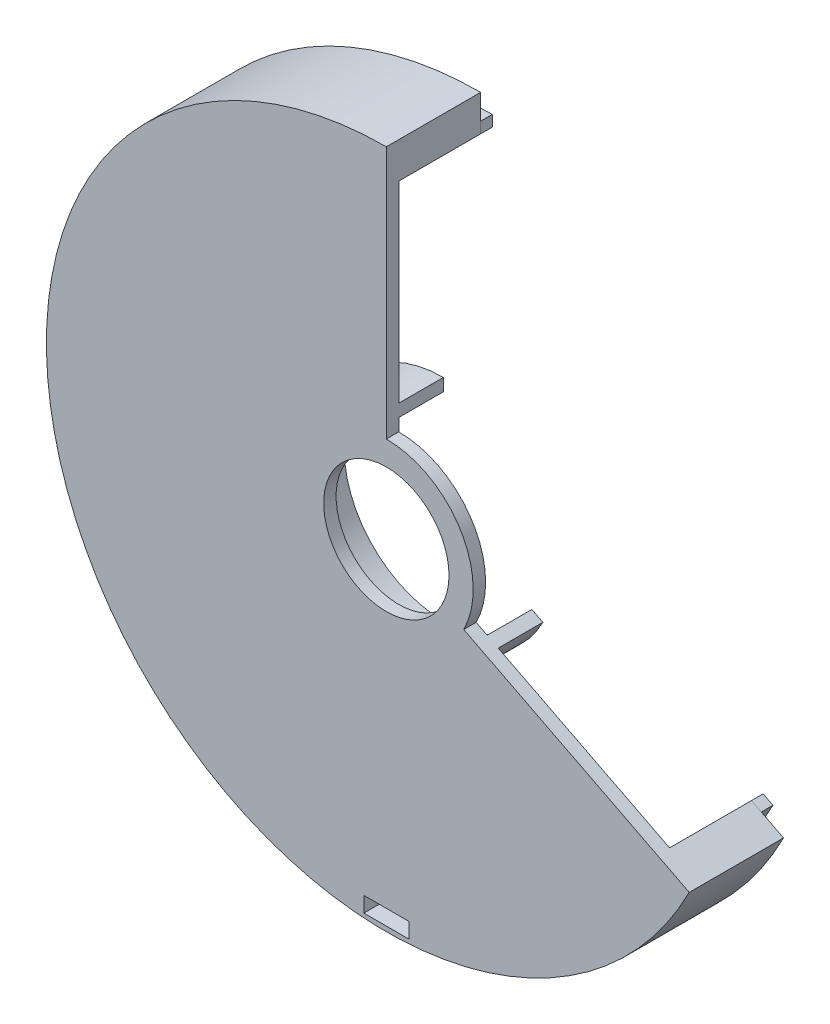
ISO-10303-21;
HEADER;
FILE_DESCRIPTION(('STEP AP214'),'2;1');
FILE_NAME('part.step','',(''),(''),'','','');
FILE_SCHEMA(('AUTOMOTIVE_DESIGN { 1 0 10303 214 1 1 1 1 }'));
ENDSEC;
DATA;
#1=APPLICATION_CONTEXT('core data for automotive mechanical design processes');
#2=APPLICATION_PROTOCOL_DEFINITION('international standard','automotive_design',2000,#1);
#3=PRODUCT_CONTEXT('',#1,'mechanical');
#4=PRODUCT('Part','Part','',(#3));
#5=PRODUCT_RELATED_PRODUCT_CATEGORY('part','',(#4));
#6=PRODUCT_DEFINITION_FORMATION('','',#4);
#7=PRODUCT_DEFINITION_CONTEXT('part definition',#1,'design');
#8=PRODUCT_DEFINITION('design','',#6,#7);
#9=PRODUCT_DEFINITION_SHAPE('','',#8);
#10=(LENGTH_UNIT() NAMED_UNIT(*) SI_UNIT(.MILLI.,.METRE.));
#11=(NAMED_UNIT(*) PLANE_ANGLE_UNIT() SI_UNIT($,.RADIAN.));
#12=(NAMED_UNIT(*) SI_UNIT($,.STERADIAN.) SOLID_ANGLE_UNIT());
#13=UNCERTAINTY_MEASURE_WITH_UNIT(LENGTH_MEASURE(1.E-05),#10,'distance_accuracy_value','');
#14=(GEOMETRIC_REPRESENTATION_CONTEXT(3) GLOBAL_UNCERTAINTY_ASSIGNED_CONTEXT((#13)) GLOBAL_UNIT_ASSIGNED_CONTEXT((#10,
#11,#12)) REPRESENTATION_CONTEXT('',''));
#15=CARTESIAN_POINT('',(0.,0.,0.));
#16=DIRECTION('',(0.,0.,1.));
#17=DIRECTION('',(1.,0.,0.));
#18=AXIS2_PLACEMENT_3D('',#15,#16,#17);
#19=CARTESIAN_POINT('',(0.,0.,24.69499995));
#20=DIRECTION('',(0.,0.,1.));
#21=DIRECTION('',(1.,0.,0.));
#22=AXIS2_PLACEMENT_3D('',#19,#20,#21);
#23=CYLINDRICAL_SURFACE('',#22,16.53875);
#24=CARTESIAN_POINT('',(0.,0.,24.69499995));
#25=DIRECTION('',(0.,0.,1.));
#26=DIRECTION('',(1.,0.,0.));
#27=AXIS2_PLACEMENT_3D('',#24,#25,#26);
#28=CIRCLE('',#27,16.53875);
#29=CARTESIAN_POINT('',(16.53875,0.,24.69499995));
#30=VERTEX_POINT('',#29);
#31=EDGE_CURVE('E232',#30,#30,#28,.T.);
#32=ORIENTED_EDGE('',*,*,#31,.F.);
#33=EDGE_LOOP('',(#32));
#34=FACE_BOUND('',#33,.T.);
#35=CARTESIAN_POINT('',(0.,0.,27.96999995));
#36=DIRECTION('',(0.,0.,1.));
#37=DIRECTION('',(1.,0.,0.));
#38=AXIS2_PLACEMENT_3D('',#35,#36,#37);
#39=CIRCLE('',#38,16.53875);
#40=CARTESIAN_POINT('',(16.53875,0.,27.96999995));
#41=VERTEX_POINT('',#40);
#42=EDGE_CURVE('E158',#41,#41,#39,.F.);
#43=ORIENTED_EDGE('',*,*,#42,.F.);
#44=EDGE_LOOP('',(#43));
#45=FACE_BOUND('',#44,.T.);
#46=ADVANCED_FACE('F44',(#34,#45),#23,.F.);
#47=CARTESIAN_POINT('',(0.,0.,44.34499995));
#48=DIRECTION('',(0.,0.,-1.));
#49=DIRECTION('',(-1.,0.,0.));
#50=AXIS2_PLACEMENT_3D('',#47,#48,#49);
#51=CYLINDRICAL_SURFACE('',#50,22.925);
#52=CARTESIAN_POINT('',(0.,0.,27.96999995));
#53=DIRECTION('',(0.,0.,1.));
#54=DIRECTION('',(1.,0.,0.));
#55=AXIS2_PLACEMENT_3D('',#52,#53,#54);
#56=CIRCLE('',#55,22.925);
#57=CARTESIAN_POINT('',(20.4263245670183,-10.4077322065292,27.96999995));
#58=VERTEX_POINT('',#57);
#59=CARTESIAN_POINT('',(0.,22.925,27.96999995));
#60=VERTEX_POINT('',#59);
#61=EDGE_CURVE('E146',#58,#60,#56,.T.);
#62=ORIENTED_EDGE('',*,*,#61,.F.);
#63=DIRECTION('',(0.,0.,1.));
#64=VECTOR('',#63,1.);
#65=CARTESIAN_POINT('',(20.4263245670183,-10.4077322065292,0.));
#66=LINE('',#65,#64);
#67=CARTESIAN_POINT('',(20.4263245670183,-10.4077322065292,24.69499995));
#68=VERTEX_POINT('',#67);
#69=EDGE_CURVE('E172',#68,#58,#66,.T.);
#70=ORIENTED_EDGE('',*,*,#69,.F.);
#71=CARTESIAN_POINT('',(0.,0.,24.69499995));
#72=DIRECTION('',(0.,0.,1.));
#73=DIRECTION('',(1.,0.,0.));
#74=AXIS2_PLACEMENT_3D('',#71,#72,#73);
#75=CIRCLE('',#74,22.925);
#76=CARTESIAN_POINT('',(0.,22.925,24.69499995));
#77=VERTEX_POINT('',#76);
#78=EDGE_CURVE('E167',#77,#68,#75,.F.);
#79=ORIENTED_EDGE('',*,*,#78,.F.);
#80=DIRECTION('',(0.,0.,1.));
#81=VECTOR('',#80,1.);
#82=CARTESIAN_POINT('',(0.,22.925,0.));
#83=LINE('',#82,#81);
#84=EDGE_CURVE('E163',#77,#60,#83,.T.);
#85=ORIENTED_EDGE('',*,*,#84,.T.);
#86=EDGE_LOOP('',(#62,#70,#79,#85));
#87=FACE_BOUND('',#86,.T.);
#88=ADVANCED_FACE('F170',(#87),#51,.T.);
#89=CARTESIAN_POINT('',(0.,0.,27.96999995));
#90=DIRECTION('',(0.,0.,1.));
#91=DIRECTION('',(1.,0.,0.));
#92=AXIS2_PLACEMENT_3D('',#89,#90,#91);
#93=PLANE('',#92);
#94=DIRECTION('',(-1.,0.,0.));
#95=VECTOR('',#94,1.);
#96=CARTESIAN_POINT('',(-5.94084999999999,-84.37055,27.96999995));
#97=LINE('',#96,#95);
#98=CARTESIAN_POINT('',(5.94084999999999,-84.37055,27.96999995));
#99=VERTEX_POINT('',#98);
#100=CARTESIAN_POINT('',(-5.94084999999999,-84.37055,27.96999995));
#101=VERTEX_POINT('',#100);
#102=EDGE_CURVE('E67',#99,#101,#97,.T.);
#103=ORIENTED_EDGE('',*,*,#102,.F.);
#104=DIRECTION('',(0.,1.,0.));
#105=VECTOR('',#104,1.);
#106=CARTESIAN_POINT('',(5.94084999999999,-88.425,27.96999995));
#107=LINE('',#106,#105);
#108=CARTESIAN_POINT('',(5.94084999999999,-88.425,27.96999995));
#109=VERTEX_POINT('',#108);
#110=EDGE_CURVE('E226',#109,#99,#107,.T.);
#111=ORIENTED_EDGE('',*,*,#110,.F.);
#112=DIRECTION('',(1.,0.,0.));
#113=VECTOR('',#112,1.);
#114=CARTESIAN_POINT('',(5.94084999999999,-88.425,27.96999995));
#115=LINE('',#114,#113);
#116=CARTESIAN_POINT('',(-5.94084999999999,-88.425,27.96999995));
#117=VERTEX_POINT('',#116);
#118=EDGE_CURVE('E223',#117,#109,#115,.T.);
#119=ORIENTED_EDGE('',*,*,#118,.F.);
#120=DIRECTION('',(0.,-1.,0.));
#121=VECTOR('',#120,1.);
#122=CARTESIAN_POINT('',(-5.94084999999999,-88.425,27.96999995));
#123=LINE('',#122,#121);
#124=EDGE_CURVE('E220',#101,#117,#123,.T.);
#125=ORIENTED_EDGE('',*,*,#124,.F.);
#126=EDGE_LOOP('',(#103,#111,#119,#125));
#127=FACE_BOUND('',#126,.T.);
#128=DIRECTION('',(0.891006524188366,-0.453990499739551,0.));
#129=VECTOR('',#128,1.);
#130=CARTESIAN_POINT('',(0.,0.,27.96999995));
#131=LINE('',#130,#129);
#132=CARTESIAN_POINT('',(79.954470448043,-40.7388374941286,27.96999995));
#133=VERTEX_POINT('',#132);
#134=EDGE_CURVE('E153',#58,#133,#131,.T.);
#135=ORIENTED_EDGE('',*,*,#134,.F.);
#136=ORIENTED_EDGE('',*,*,#61,.T.);
#137=DIRECTION('',(0.,1.,0.));
#138=VECTOR('',#137,1.);
#139=CARTESIAN_POINT('',(0.,0.,27.96999995));
#140=LINE('',#139,#138);
#141=CARTESIAN_POINT('',(0.,89.735,27.96999995));
#142=VERTEX_POINT('',#141);
#143=EDGE_CURVE('E151',#60,#142,#140,.T.);
#144=ORIENTED_EDGE('',*,*,#143,.T.);
#145=CARTESIAN_POINT('',(0.,0.,27.96999995));
#146=DIRECTION('',(0.,0.,1.));
#147=DIRECTION('',(1.,0.,0.));
#148=AXIS2_PLACEMENT_3D('',#145,#146,#147);
#149=CIRCLE('',#148,89.735);
#150=EDGE_CURVE('E245',#142,#133,#149,.T.);
#151=ORIENTED_EDGE('',*,*,#150,.T.);
#152=EDGE_LOOP('',(#135,#136,#144,#151));
#153=FACE_BOUND('',#152,.T.);
#154=ORIENTED_EDGE('',*,*,#42,.T.);
#155=EDGE_LOOP('',(#154));
#156=FACE_BOUND('',#155,.T.);
#157=ADVANCED_FACE('F148',(#127,#153,#156),#93,.T.);
#158=CARTESIAN_POINT('',(0.,0.,27.96999995));
#159=DIRECTION('',(0.,0.,-1.));
#160=DIRECTION('',(-1.,0.,0.));
#161=AXIS2_PLACEMENT_3D('',#158,#159,#160);
#162=CYLINDRICAL_SURFACE('',#161,80.2375);
#163=CARTESIAN_POINT('',(0.,0.,3.07999995));
#164=DIRECTION('',(0.,0.,1.));
#165=DIRECTION('',(1.,0.,0.));
#166=AXIS2_PLACEMENT_3D('',#163,#164,#165);
#167=CIRCLE('',#166,80.2375);
#168=CARTESIAN_POINT('',(0.,80.2375,3.07999995));
#169=VERTEX_POINT('',#168);
#170=CARTESIAN_POINT('',(71.492135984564,-36.4270627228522,3.07999995));
#171=VERTEX_POINT('',#170);
#172=EDGE_CURVE('E241',#169,#171,#167,.T.);
#173=ORIENTED_EDGE('',*,*,#172,.F.);
#174=DIRECTION('',(0.,0.,-1.));
#175=VECTOR('',#174,1.);
#176=CARTESIAN_POINT('',(0.,80.2375,27.96999995));
#177=LINE('',#176,#175);
#178=CARTESIAN_POINT('',(0.,80.2375,24.69499995));
#179=VERTEX_POINT('',#178);
#180=EDGE_CURVE('E205',#169,#179,#177,.F.);
#181=ORIENTED_EDGE('',*,*,#180,.T.);
#182=CARTESIAN_POINT('',(0.,0.,24.69499995));
#183=DIRECTION('',(0.,0.,1.));
#184=DIRECTION('',(1.,0.,0.));
#185=AXIS2_PLACEMENT_3D('',#182,#183,#184);
#186=CIRCLE('',#185,80.2375);
#187=CARTESIAN_POINT('',(71.492135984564,-36.4270627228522,24.69499995));
#188=VERTEX_POINT('',#187);
#189=EDGE_CURVE('E240',#179,#188,#186,.T.);
#190=ORIENTED_EDGE('',*,*,#189,.T.);
#191=DIRECTION('',(0.,0.,-1.));
#192=VECTOR('',#191,1.);
#193=CARTESIAN_POINT('',(71.492135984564,-36.4270627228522,27.96999995));
#194=LINE('',#193,#192);
#195=EDGE_CURVE('E190',#171,#188,#194,.F.);
#196=ORIENTED_EDGE('',*,*,#195,.F.);
#197=EDGE_LOOP('',(#173,#181,#190,#196));
#198=FACE_BOUND('',#197,.T.);
#199=ADVANCED_FACE('F287',(#198),#162,.F.);
#200=CARTESIAN_POINT('',(0.,0.,3.07999995));
#201=DIRECTION('',(0.,0.,1.));
#202=DIRECTION('',(1.,0.,0.));
#203=AXIS2_PLACEMENT_3D('',#200,#201,#202);
#204=PLANE('',#203);
#205=DIRECTION('',(0.,1.,0.));
#206=VECTOR('',#205,1.);
#207=CARTESIAN_POINT('',(5.94084999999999,0.,3.07999995));
#208=LINE('',#207,#206);
#209=CARTESIAN_POINT('',(5.94084999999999,-88.425,3.07999995));
#210=VERTEX_POINT('',#209);
#211=CARTESIAN_POINT('',(5.94084999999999,-84.37055,3.07999995));
#212=VERTEX_POINT('',#211);
#213=EDGE_CURVE('E257',#210,#212,#208,.T.);
#214=ORIENTED_EDGE('',*,*,#213,.T.);
#215=DIRECTION('',(-1.,0.,0.));
#216=VECTOR('',#215,1.);
#217=CARTESIAN_POINT('',(0.,-84.37055,3.07999995));
#218=LINE('',#217,#216);
#219=CARTESIAN_POINT('',(-5.94084999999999,-84.37055,3.07999995));
#220=VERTEX_POINT('',#219);
#221=EDGE_CURVE('E260',#212,#220,#218,.T.);
#222=ORIENTED_EDGE('',*,*,#221,.T.);
#223=DIRECTION('',(0.,-1.,0.));
#224=VECTOR('',#223,1.);
#225=CARTESIAN_POINT('',(-5.94084999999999,0.,3.07999995));
#226=LINE('',#225,#224);
#227=CARTESIAN_POINT('',(-5.94084999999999,-88.425,3.07999995));
#228=VERTEX_POINT('',#227);
#229=EDGE_CURVE('E247',#220,#228,#226,.T.);
#230=ORIENTED_EDGE('',*,*,#229,.T.);
#231=DIRECTION('',(1.,0.,0.));
#232=VECTOR('',#231,1.);
#233=CARTESIAN_POINT('',(0.,-88.425,3.07999995));
#234=LINE('',#233,#232);
#235=EDGE_CURVE('E254',#228,#210,#234,.T.);
#236=ORIENTED_EDGE('',*,*,#235,.T.);
#237=EDGE_LOOP('',(#214,#222,#230,#236));
#238=FACE_BOUND('',#237,.T.);
#239=DIRECTION('',(0.,1.,0.));
#240=VECTOR('',#239,1.);
#241=CARTESIAN_POINT('',(0.,0.,3.07999995));
#242=LINE('',#241,#240);
#243=CARTESIAN_POINT('',(0.,89.735,3.07999995));
#244=VERTEX_POINT('',#243);
#245=EDGE_CURVE('E168',#169,#244,#242,.T.);
#246=ORIENTED_EDGE('',*,*,#245,.F.);
#247=ORIENTED_EDGE('',*,*,#172,.T.);
#248=DIRECTION('',(0.891006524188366,-0.453990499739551,0.));
#249=VECTOR('',#248,1.);
#250=CARTESIAN_POINT('',(0.,0.,3.07999995));
#251=LINE('',#250,#249);
#252=CARTESIAN_POINT('',(79.954470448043,-40.7388374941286,3.07999995));
#253=VERTEX_POINT('',#252);
#254=EDGE_CURVE('E192',#171,#253,#251,.T.);
#255=ORIENTED_EDGE('',*,*,#254,.T.);
#256=CARTESIAN_POINT('',(0.,0.,3.07999995));
#257=DIRECTION('',(0.,0.,1.));
#258=DIRECTION('',(1.,0.,0.));
#259=AXIS2_PLACEMENT_3D('',#256,#257,#258);
#260=CIRCLE('',#259,89.735);
#261=EDGE_CURVE('E244',#244,#253,#260,.T.);
#262=ORIENTED_EDGE('',*,*,#261,.F.);
#263=EDGE_LOOP('',(#246,#247,#255,#262));
#264=FACE_BOUND('',#263,.T.);
#265=ADVANCED_FACE('F291',(#238,#264),#204,.F.);
#266=CARTESIAN_POINT('',(0.,0.,27.96999995));
#267=DIRECTION('',(0.,0.,-1.));
#268=DIRECTION('',(-1.,0.,0.));
#269=AXIS2_PLACEMENT_3D('',#266,#267,#268);
#270=CYLINDRICAL_SURFACE('',#269,89.735);
#271=DIRECTION('',(0.,0.,1.));
#272=VECTOR('',#271,1.);
#273=CARTESIAN_POINT('',(0.,89.735,0.));
#274=LINE('',#273,#272);
#275=EDGE_CURVE('E166',#244,#142,#274,.T.);
#276=ORIENTED_EDGE('',*,*,#275,.F.);
#277=ORIENTED_EDGE('',*,*,#261,.T.);
#278=DIRECTION('',(0.,0.,1.));
#279=VECTOR('',#278,1.);
#280=CARTESIAN_POINT('',(79.954470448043,-40.7388374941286,0.));
#281=LINE('',#280,#279);
#282=EDGE_CURVE('E174',#253,#133,#281,.T.);
#283=ORIENTED_EDGE('',*,*,#282,.T.);
#284=ORIENTED_EDGE('',*,*,#150,.F.);
#285=EDGE_LOOP('',(#276,#277,#283,#284));
#286=FACE_BOUND('',#285,.T.);
#287=ADVANCED_FACE('F46',(#286),#270,.T.);
#288=CARTESIAN_POINT('',(0.,0.,24.69499995));
#289=DIRECTION('',(0.,0.,1.));
#290=DIRECTION('',(1.,0.,0.));
#291=AXIS2_PLACEMENT_3D('',#288,#289,#290);
#292=PLANE('',#291);
#293=DIRECTION('',(0.,1.,0.));
#294=VECTOR('',#293,1.);
#295=CARTESIAN_POINT('',(0.,0.,24.69499995));
#296=LINE('',#295,#294);
#297=CARTESIAN_POINT('',(0.,29.475,24.69499995));
#298=VERTEX_POINT('',#297);
#299=EDGE_CURVE('E203',#298,#179,#296,.T.);
#300=ORIENTED_EDGE('',*,*,#299,.F.);
#301=CARTESIAN_POINT('',(0.,0.,24.69499995));
#302=DIRECTION('',(0.,0.,1.));
#303=DIRECTION('',(1.,0.,0.));
#304=AXIS2_PLACEMENT_3D('',#301,#302,#303);
#305=CIRCLE('',#304,29.475);
#306=CARTESIAN_POINT('',(26.2624173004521,-13.3813699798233,24.69499995));
#307=VERTEX_POINT('',#306);
#308=EDGE_CURVE('E263',#307,#298,#305,.F.);
#309=ORIENTED_EDGE('',*,*,#308,.F.);
#310=DIRECTION('',(0.891006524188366,-0.453990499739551,0.));
#311=VECTOR('',#310,1.);
#312=CARTESIAN_POINT('',(0.,0.,24.69499995));
#313=LINE('',#312,#311);
#314=EDGE_CURVE('E187',#307,#188,#313,.T.);
#315=ORIENTED_EDGE('',*,*,#314,.T.);
#316=ORIENTED_EDGE('',*,*,#189,.F.);
#317=EDGE_LOOP('',(#300,#309,#315,#316));
#318=FACE_BOUND('',#317,.T.);
#319=ADVANCED_FACE('F283',(#318),#292,.F.);
#320=CARTESIAN_POINT('',(0.,0.,12.90499995));
#321=DIRECTION('',(0.,0.,-1.));
#322=DIRECTION('',(-1.,0.,0.));
#323=AXIS2_PLACEMENT_3D('',#320,#321,#322);
#324=PLANE('',#323);
#325=CARTESIAN_POINT('',(0.,0.,12.90499995));
#326=DIRECTION('',(0.,0.,-1.));
#327=DIRECTION('',(-1.,0.,0.));
#328=AXIS2_PLACEMENT_3D('',#325,#326,#327);
#329=CIRCLE('',#328,29.475);
#330=CARTESIAN_POINT('',(26.2624173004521,-13.3813699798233,12.90499995));
#331=VERTEX_POINT('',#330);
#332=CARTESIAN_POINT('',(0.,29.475,12.90499995));
#333=VERTEX_POINT('',#332);
#334=EDGE_CURVE('E214',#331,#333,#329,.T.);
#335=ORIENTED_EDGE('',*,*,#334,.T.);
#336=DIRECTION('',(0.,-1.,0.));
#337=VECTOR('',#336,1.);
#338=CARTESIAN_POINT('',(0.,0.,12.90499995));
#339=LINE('',#338,#337);
#340=CARTESIAN_POINT('',(0.,26.2,12.90499995));
#341=VERTEX_POINT('',#340);
#342=EDGE_CURVE('E196',#333,#341,#339,.T.);
#343=ORIENTED_EDGE('',*,*,#342,.T.);
#344=CARTESIAN_POINT('',(0.,0.,12.90499995));
#345=DIRECTION('',(0.,0.,-1.));
#346=DIRECTION('',(-1.,0.,0.));
#347=AXIS2_PLACEMENT_3D('',#344,#345,#346);
#348=CIRCLE('',#347,26.2);
#349=CARTESIAN_POINT('',(23.3443709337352,-11.8945510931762,12.90499995));
#350=VERTEX_POINT('',#349);
#351=EDGE_CURVE('E211',#350,#341,#348,.T.);
#352=ORIENTED_EDGE('',*,*,#351,.F.);
#353=DIRECTION('',(-0.891006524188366,0.453990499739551,0.));
#354=VECTOR('',#353,1.);
#355=CARTESIAN_POINT('',(0.,0.,12.90499995));
#356=LINE('',#355,#354);
#357=EDGE_CURVE('E59',#331,#350,#356,.T.);
#358=ORIENTED_EDGE('',*,*,#357,.F.);
#359=EDGE_LOOP('',(#335,#343,#352,#358));
#360=FACE_BOUND('',#359,.T.);
#361=ADVANCED_FACE('F275',(#360),#324,.T.);
#362=CARTESIAN_POINT('',(0.,0.,12.90499995));
#363=DIRECTION('',(0.,0.,1.));
#364=DIRECTION('',(1.,0.,0.));
#365=AXIS2_PLACEMENT_3D('',#362,#363,#364);
#366=CYLINDRICAL_SURFACE('',#365,29.475);
#367=DIRECTION('',(0.,0.,1.));
#368=VECTOR('',#367,1.);
#369=CARTESIAN_POINT('',(0.,29.475,12.90499995));
#370=LINE('',#369,#368);
#371=EDGE_CURVE('E201',#333,#298,#370,.T.);
#372=ORIENTED_EDGE('',*,*,#371,.F.);
#373=ORIENTED_EDGE('',*,*,#334,.F.);
#374=DIRECTION('',(0.,0.,1.));
#375=VECTOR('',#374,1.);
#376=CARTESIAN_POINT('',(26.2624173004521,-13.3813699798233,12.90499995));
#377=LINE('',#376,#375);
#378=EDGE_CURVE('E184',#331,#307,#377,.T.);
#379=ORIENTED_EDGE('',*,*,#378,.T.);
#380=ORIENTED_EDGE('',*,*,#308,.T.);
#381=EDGE_LOOP('',(#372,#373,#379,#380));
#382=FACE_BOUND('',#381,.T.);
#383=ADVANCED_FACE('F278',(#382),#366,.T.);
#384=CARTESIAN_POINT('',(0.,0.,12.90499995));
#385=DIRECTION('',(0.,0.,1.));
#386=DIRECTION('',(1.,0.,0.));
#387=AXIS2_PLACEMENT_3D('',#384,#385,#386);
#388=CYLINDRICAL_SURFACE('',#387,26.2);
#389=ORIENTED_EDGE('',*,*,#351,.T.);
#390=DIRECTION('',(0.,0.,1.));
#391=VECTOR('',#390,1.);
#392=CARTESIAN_POINT('',(0.,26.2,12.90499995));
#393=LINE('',#392,#391);
#394=CARTESIAN_POINT('',(0.,26.2,24.69499995));
#395=VERTEX_POINT('',#394);
#396=EDGE_CURVE('E12',#341,#395,#393,.T.);
#397=ORIENTED_EDGE('',*,*,#396,.T.);
#398=CARTESIAN_POINT('',(0.,0.,24.69499995));
#399=DIRECTION('',(0.,0.,-1.));
#400=DIRECTION('',(-1.,0.,0.));
#401=AXIS2_PLACEMENT_3D('',#398,#399,#400);
#402=CIRCLE('',#401,26.2);
#403=CARTESIAN_POINT('',(23.3443709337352,-11.8945510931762,24.69499995));
#404=VERTEX_POINT('',#403);
#405=EDGE_CURVE('E210',#404,#395,#402,.T.);
#406=ORIENTED_EDGE('',*,*,#405,.F.);
#407=DIRECTION('',(0.,0.,1.));
#408=VECTOR('',#407,1.);
#409=CARTESIAN_POINT('',(23.3443709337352,-11.8945510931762,12.90499995));
#410=LINE('',#409,#408);
#411=EDGE_CURVE('E52',#350,#404,#410,.T.);
#412=ORIENTED_EDGE('',*,*,#411,.F.);
#413=EDGE_LOOP('',(#389,#397,#406,#412));
#414=FACE_BOUND('',#413,.T.);
#415=ADVANCED_FACE('F272',(#414),#388,.F.);
#416=DIRECTION('',(0.,1.,0.));
#417=VECTOR('',#416,1.);
#418=CARTESIAN_POINT('',(0.,0.,24.69499995));
#419=LINE('',#418,#417);
#420=EDGE_CURVE('E199',#77,#395,#419,.T.);
#421=ORIENTED_EDGE('',*,*,#420,.F.);
#422=ORIENTED_EDGE('',*,*,#78,.T.);
#423=DIRECTION('',(0.891006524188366,-0.453990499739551,0.));
#424=VECTOR('',#423,1.);
#425=CARTESIAN_POINT('',(0.,0.,24.69499995));
#426=LINE('',#425,#424);
#427=EDGE_CURVE('E181',#68,#404,#426,.T.);
#428=ORIENTED_EDGE('',*,*,#427,.T.);
#429=ORIENTED_EDGE('',*,*,#405,.T.);
#430=EDGE_LOOP('',(#421,#422,#428,#429));
#431=FACE_BOUND('',#430,.T.);
#432=ORIENTED_EDGE('',*,*,#31,.T.);
#433=EDGE_LOOP('',(#432));
#434=FACE_BOUND('',#433,.T.);
#435=ADVANCED_FACE('F270',(#431,#434),#292,.F.);
#436=CARTESIAN_POINT('',(-5.94084999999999,-84.37055,-14.60500005));
#437=DIRECTION('',(0.,1.,0.));
#438=DIRECTION('',(0.,0.,1.));
#439=AXIS2_PLACEMENT_3D('',#436,#437,#438);
#440=PLANE('',#439);
#441=DIRECTION('',(0.,0.,1.));
#442=VECTOR('',#441,1.);
#443=CARTESIAN_POINT('',(5.94084999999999,-84.37055,-14.60500005));
#444=LINE('',#443,#442);
#445=EDGE_CURVE('E230',#212,#99,#444,.T.);
#446=ORIENTED_EDGE('',*,*,#445,.T.);
#447=ORIENTED_EDGE('',*,*,#102,.T.);
#448=DIRECTION('',(0.,0.,1.));
#449=VECTOR('',#448,1.);
#450=CARTESIAN_POINT('',(-5.94084999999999,-84.37055,-14.60500005));
#451=LINE('',#450,#449);
#452=EDGE_CURVE('E229',#220,#101,#451,.T.);
#453=ORIENTED_EDGE('',*,*,#452,.F.);
#454=ORIENTED_EDGE('',*,*,#221,.F.);
#455=EDGE_LOOP('',(#446,#447,#453,#454));
#456=FACE_BOUND('',#455,.T.);
#457=ADVANCED_FACE('F325',(#456),#440,.F.);
#458=CARTESIAN_POINT('',(5.94084999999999,-88.425,-14.60500005));
#459=DIRECTION('',(1.,0.,0.));
#460=DIRECTION('',(0.,0.,-1.));
#461=AXIS2_PLACEMENT_3D('',#458,#459,#460);
#462=PLANE('',#461);
#463=DIRECTION('',(0.,0.,1.));
#464=VECTOR('',#463,1.);
#465=CARTESIAN_POINT('',(5.94084999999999,-88.425,-14.60500005));
#466=LINE('',#465,#464);
#467=EDGE_CURVE('E233',#210,#109,#466,.T.);
#468=ORIENTED_EDGE('',*,*,#467,.T.);
#469=ORIENTED_EDGE('',*,*,#110,.T.);
#470=ORIENTED_EDGE('',*,*,#445,.F.);
#471=ORIENTED_EDGE('',*,*,#213,.F.);
#472=EDGE_LOOP('',(#468,#469,#470,#471));
#473=FACE_BOUND('',#472,.T.);
#474=ADVANCED_FACE('F329',(#473),#462,.F.);
#475=CARTESIAN_POINT('',(5.94084999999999,-88.425,-14.60500005));
#476=DIRECTION('',(0.,-1.,0.));
#477=DIRECTION('',(0.,0.,-1.));
#478=AXIS2_PLACEMENT_3D('',#475,#476,#477);
#479=PLANE('',#478);
#480=DIRECTION('',(0.,0.,1.));
#481=VECTOR('',#480,1.);
#482=CARTESIAN_POINT('',(-5.94084999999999,-88.425,-14.60500005));
#483=LINE('',#482,#481);
#484=EDGE_CURVE('E235',#228,#117,#483,.T.);
#485=ORIENTED_EDGE('',*,*,#484,.T.);
#486=ORIENTED_EDGE('',*,*,#118,.T.);
#487=ORIENTED_EDGE('',*,*,#467,.F.);
#488=ORIENTED_EDGE('',*,*,#235,.F.);
#489=EDGE_LOOP('',(#485,#486,#487,#488));
#490=FACE_BOUND('',#489,.T.);
#491=ADVANCED_FACE('F331',(#490),#479,.F.);
#492=CARTESIAN_POINT('',(-5.94084999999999,-88.425,-14.60500005));
#493=DIRECTION('',(-1.,0.,0.));
#494=DIRECTION('',(0.,0.,1.));
#495=AXIS2_PLACEMENT_3D('',#492,#493,#494);
#496=PLANE('',#495);
#497=ORIENTED_EDGE('',*,*,#452,.T.);
#498=ORIENTED_EDGE('',*,*,#124,.T.);
#499=ORIENTED_EDGE('',*,*,#484,.F.);
#500=ORIENTED_EDGE('',*,*,#229,.F.);
#501=EDGE_LOOP('',(#497,#498,#499,#500));
#502=FACE_BOUND('',#501,.T.);
#503=ADVANCED_FACE('F323',(#502),#496,.F.);
#504=CARTESIAN_POINT('',(0.,0.,0.));
#505=DIRECTION('',(1.,0.,0.));
#506=DIRECTION('',(0.,0.,-1.));
#507=AXIS2_PLACEMENT_3D('',#504,#505,#506);
#508=PLANE('',#507);
#509=ORIENTED_EDGE('',*,*,#84,.F.);
#510=ORIENTED_EDGE('',*,*,#420,.T.);
#511=ORIENTED_EDGE('',*,*,#396,.F.);
#512=ORIENTED_EDGE('',*,*,#342,.F.);
#513=ORIENTED_EDGE('',*,*,#371,.T.);
#514=ORIENTED_EDGE('',*,*,#299,.T.);
#515=ORIENTED_EDGE('',*,*,#180,.F.);
#516=ORIENTED_EDGE('',*,*,#245,.T.);
#517=ORIENTED_EDGE('',*,*,#275,.T.);
#518=ORIENTED_EDGE('',*,*,#143,.F.);
#519=EDGE_LOOP('',(#509,#510,#511,#512,#513,#514,#515,#516,#517,#518));
#520=FACE_BOUND('',#519,.T.);
#521=ADVANCED_FACE('F162',(#520),#508,.T.);
#522=CARTESIAN_POINT('',(0.,0.,0.));
#523=DIRECTION('',(-0.453990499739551,-0.891006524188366,0.));
#524=DIRECTION('',(0.891006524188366,-0.453990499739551,0.));
#525=AXIS2_PLACEMENT_3D('',#522,#523,#524);
#526=PLANE('',#525);
#527=ORIENTED_EDGE('',*,*,#134,.T.);
#528=ORIENTED_EDGE('',*,*,#282,.F.);
#529=ORIENTED_EDGE('',*,*,#254,.F.);
#530=ORIENTED_EDGE('',*,*,#195,.T.);
#531=ORIENTED_EDGE('',*,*,#314,.F.);
#532=ORIENTED_EDGE('',*,*,#378,.F.);
#533=ORIENTED_EDGE('',*,*,#357,.T.);
#534=ORIENTED_EDGE('',*,*,#411,.T.);
#535=ORIENTED_EDGE('',*,*,#427,.F.);
#536=ORIENTED_EDGE('',*,*,#69,.T.);
#537=EDGE_LOOP('',(#527,#528,#529,#530,#531,#532,#533,#534,#535,#536));
#538=FACE_BOUND('',#537,.T.);
#539=ADVANCED_FACE('F265',(#538),#526,.F.);
#540=CLOSED_SHELL('',(#46,#88,#157,#199,#265,#287,#319,#361,#383,#415,#435,#457,#474,#491,#503,
#521,#539));
#541=MANIFOLD_SOLID_BREP('B2',#540);
#542=CARTESIAN_POINT('',(0.,0.,3.07999995));
#543=DIRECTION('',(0.,0.,1.));
#544=DIRECTION('',(1.,0.,0.));
#545=AXIS2_PLACEMENT_3D('',#542,#543,#544);
#546=PLANE('',#545);
#547=CARTESIAN_POINT('',(0.,0.,3.07999995));
#548=DIRECTION('',(0.,0.,1.));
#549=DIRECTION('',(1.,0.,0.));
#550=AXIS2_PLACEMENT_3D('',#547,#548,#549);
#551=CIRCLE('',#550,80.2375);
#552=CARTESIAN_POINT('',(0.,80.2375,3.07999995));
#553=VERTEX_POINT('',#552);
#554=CARTESIAN_POINT('',(71.492135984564,-36.4270627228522,3.07999995));
#555=VERTEX_POINT('',#554);
#556=EDGE_CURVE('E517',#553,#555,#551,.T.);
#557=ORIENTED_EDGE('',*,*,#556,.F.);
#558=DIRECTION('',(0.,1.,0.));
#559=VECTOR('',#558,1.);
#560=CARTESIAN_POINT('',(0.,0.,3.07999995));
#561=LINE('',#560,#559);
#562=CARTESIAN_POINT('',(0.,83.15225,3.07999995));
#563=VERTEX_POINT('',#562);
#564=EDGE_CURVE('E486',#553,#563,#561,.T.);
#565=ORIENTED_EDGE('',*,*,#564,.T.);
#566=CARTESIAN_POINT('',(0.,0.,3.07999995));
#567=DIRECTION('',(0.,0.,1.));
#568=DIRECTION('',(1.,0.,0.));
#569=AXIS2_PLACEMENT_3D('',#566,#567,#568);
#570=CIRCLE('',#569,83.15225);
#571=CARTESIAN_POINT('',(74.0891972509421,-37.7503315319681,3.07999995));
#572=VERTEX_POINT('',#571);
#573=EDGE_CURVE('E523',#563,#572,#570,.T.);
#574=ORIENTED_EDGE('',*,*,#573,.T.);
#575=DIRECTION('',(0.891006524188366,-0.453990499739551,0.));
#576=VECTOR('',#575,1.);
#577=CARTESIAN_POINT('',(0.,0.,3.07999995));
#578=LINE('',#577,#576);
#579=EDGE_CURVE('E528',#555,#572,#578,.T.);
#580=ORIENTED_EDGE('',*,*,#579,.F.);
#581=EDGE_LOOP('',(#557,#565,#574,#580));
#582=FACE_BOUND('',#581,.T.);
#583=ADVANCED_FACE('F463',(#582),#546,.T.);
#584=CARTESIAN_POINT('',(0.,0.,0.));
#585=DIRECTION('',(0.,0.,1.));
#586=DIRECTION('',(1.,0.,0.));
#587=AXIS2_PLACEMENT_3D('',#584,#585,#586);
#588=PLANE('',#587);
#589=DIRECTION('',(0.,1.,0.));
#590=VECTOR('',#589,1.);
#591=CARTESIAN_POINT('',(0.,0.,0.));
#592=LINE('',#591,#590);
#593=CARTESIAN_POINT('',(0.,80.2375,0.));
#594=VERTEX_POINT('',#593);
#595=CARTESIAN_POINT('',(0.,83.15225,0.));
#596=VERTEX_POINT('',#595);
#597=EDGE_CURVE('E502',#594,#596,#592,.T.);
#598=ORIENTED_EDGE('',*,*,#597,.F.);
#599=CARTESIAN_POINT('',(0.,0.,0.));
#600=DIRECTION('',(0.,0.,1.));
#601=DIRECTION('',(1.,0.,0.));
#602=AXIS2_PLACEMENT_3D('',#599,#600,#601);
#603=CIRCLE('',#602,80.2375);
#604=CARTESIAN_POINT('',(71.492135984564,-36.4270627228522,0.));
#605=VERTEX_POINT('',#604);
#606=EDGE_CURVE('E512',#594,#605,#603,.T.);
#607=ORIENTED_EDGE('',*,*,#606,.T.);
#608=DIRECTION('',(0.891006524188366,-0.453990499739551,0.));
#609=VECTOR('',#608,1.);
#610=CARTESIAN_POINT('',(0.,0.,0.));
#611=LINE('',#610,#609);
#612=CARTESIAN_POINT('',(74.089197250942,-37.7503315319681,0.));
#613=VERTEX_POINT('',#612);
#614=EDGE_CURVE('E478',#605,#613,#611,.T.);
#615=ORIENTED_EDGE('',*,*,#614,.T.);
#616=CARTESIAN_POINT('',(0.,0.,0.));
#617=DIRECTION('',(0.,0.,1.));
#618=DIRECTION('',(1.,0.,0.));
#619=AXIS2_PLACEMENT_3D('',#616,#617,#618);
#620=CIRCLE('',#619,83.15225);
#621=EDGE_CURVE('E514',#596,#613,#620,.T.);
#622=ORIENTED_EDGE('',*,*,#621,.F.);
#623=EDGE_LOOP('',(#598,#607,#615,#622));
#624=FACE_BOUND('',#623,.T.);
#625=ADVANCED_FACE('F511',(#624),#588,.F.);
#626=CARTESIAN_POINT('',(0.,0.,3.07999995));
#627=DIRECTION('',(0.,0.,-1.));
#628=DIRECTION('',(-1.,0.,0.));
#629=AXIS2_PLACEMENT_3D('',#626,#627,#628);
#630=CYLINDRICAL_SURFACE('',#629,83.15225);
#631=DIRECTION('',(0.,0.,-1.));
#632=VECTOR('',#631,1.);
#633=CARTESIAN_POINT('',(0.,83.15225,3.07999995));
#634=LINE('',#633,#632);
#635=EDGE_CURVE('E518',#596,#563,#634,.F.);
#636=ORIENTED_EDGE('',*,*,#635,.F.);
#637=ORIENTED_EDGE('',*,*,#621,.T.);
#638=DIRECTION('',(0.,0.,-1.));
#639=VECTOR('',#638,1.);
#640=CARTESIAN_POINT('',(74.089197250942,-37.7503315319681,3.07999995));
#641=LINE('',#640,#639);
#642=EDGE_CURVE('E532',#613,#572,#641,.F.);
#643=ORIENTED_EDGE('',*,*,#642,.T.);
#644=ORIENTED_EDGE('',*,*,#573,.F.);
#645=EDGE_LOOP('',(#636,#637,#643,#644));
#646=FACE_BOUND('',#645,.T.);
#647=ADVANCED_FACE('F465',(#646),#630,.T.);
#648=CARTESIAN_POINT('',(0.,0.,3.07999995));
#649=DIRECTION('',(0.,0.,-1.));
#650=DIRECTION('',(-1.,0.,0.));
#651=AXIS2_PLACEMENT_3D('',#648,#649,#650);
#652=CYLINDRICAL_SURFACE('',#651,80.2375);
#653=ORIENTED_EDGE('',*,*,#606,.F.);
#654=DIRECTION('',(0.,0.,-1.));
#655=VECTOR('',#654,1.);
#656=CARTESIAN_POINT('',(0.,80.2375,3.07999995));
#657=LINE('',#656,#655);
#658=EDGE_CURVE('E42',#594,#553,#657,.F.);
#659=ORIENTED_EDGE('',*,*,#658,.T.);
#660=ORIENTED_EDGE('',*,*,#556,.T.);
#661=DIRECTION('',(0.,0.,-1.));
#662=VECTOR('',#661,1.);
#663=CARTESIAN_POINT('',(71.492135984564,-36.4270627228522,3.07999995));
#664=LINE('',#663,#662);
#665=EDGE_CURVE('E471',#605,#555,#664,.F.);
#666=ORIENTED_EDGE('',*,*,#665,.F.);
#667=EDGE_LOOP('',(#653,#659,#660,#666));
#668=FACE_BOUND('',#667,.T.);
#669=ADVANCED_FACE('F516',(#668),#652,.F.);
#670=CARTESIAN_POINT('',(0.,0.,0.));
#671=DIRECTION('',(-0.453990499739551,-0.891006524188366,0.));
#672=DIRECTION('',(0.891006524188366,-0.453990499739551,0.));
#673=AXIS2_PLACEMENT_3D('',#670,#671,#672);
#674=PLANE('',#673);
#675=ORIENTED_EDGE('',*,*,#614,.F.);
#676=ORIENTED_EDGE('',*,*,#665,.T.);
#677=ORIENTED_EDGE('',*,*,#579,.T.);
#678=ORIENTED_EDGE('',*,*,#642,.F.);
#679=EDGE_LOOP('',(#675,#676,#677,#678));
#680=FACE_BOUND('',#679,.T.);
#681=ADVANCED_FACE('F527',(#680),#674,.F.);
#682=CARTESIAN_POINT('',(0.,0.,0.));
#683=DIRECTION('',(1.,0.,0.));
#684=DIRECTION('',(0.,0.,-1.));
#685=AXIS2_PLACEMENT_3D('',#682,#683,#684);
#686=PLANE('',#685);
#687=ORIENTED_EDGE('',*,*,#635,.T.);
#688=ORIENTED_EDGE('',*,*,#564,.F.);
#689=ORIENTED_EDGE('',*,*,#658,.F.);
#690=ORIENTED_EDGE('',*,*,#597,.T.);
#691=EDGE_LOOP('',(#687,#688,#689,#690));
#692=FACE_BOUND('',#691,.T.);
#693=ADVANCED_FACE('F501',(#692),#686,.T.);
#694=CLOSED_SHELL('',(#583,#625,#647,#669,#681,#693));
#695=MANIFOLD_SOLID_BREP('B6',#694);
#696=ADVANCED_BREP_SHAPE_REPRESENTATION('',(#18,#541,#695),#14);
#697=SHAPE_DEFINITION_REPRESENTATION(#9,#696);
ENDSEC;
END-ISO-10303-21;
